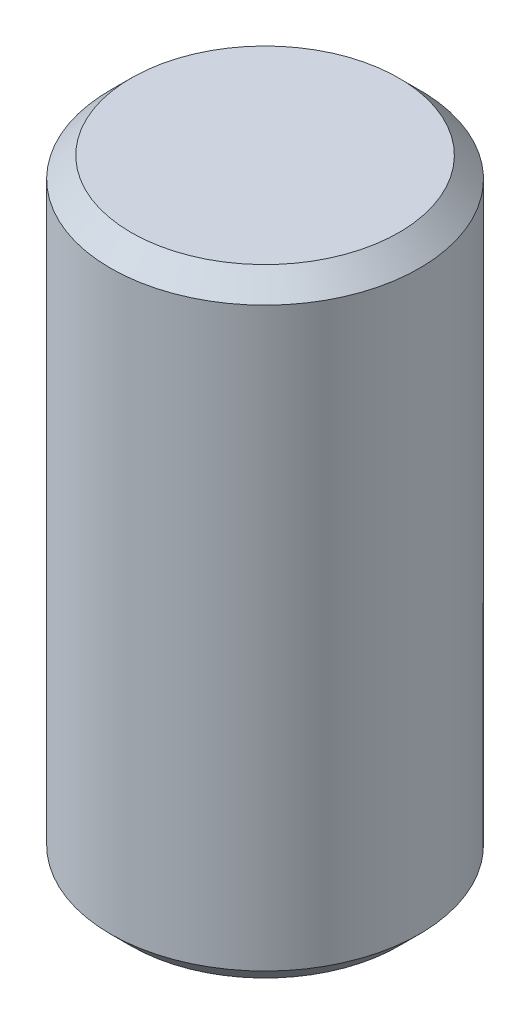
ISO-10303-21;
HEADER;
FILE_DESCRIPTION(('STEP AP214'),'2;1');
FILE_NAME('part.step','',(''),(''),'','','');
FILE_SCHEMA(('AUTOMOTIVE_DESIGN { 1 0 10303 214 1 1 1 1 }'));
ENDSEC;
DATA;
#1=APPLICATION_CONTEXT('core data for automotive mechanical design processes');
#2=APPLICATION_PROTOCOL_DEFINITION('international standard','automotive_design',2000,#1);
#3=PRODUCT_CONTEXT('',#1,'mechanical');
#4=PRODUCT('Part','Part','',(#3));
#5=PRODUCT_RELATED_PRODUCT_CATEGORY('part','',(#4));
#6=PRODUCT_DEFINITION_FORMATION('','',#4);
#7=PRODUCT_DEFINITION_CONTEXT('part definition',#1,'design');
#8=PRODUCT_DEFINITION('design','',#6,#7);
#9=PRODUCT_DEFINITION_SHAPE('','',#8);
#10=(LENGTH_UNIT() NAMED_UNIT(*) SI_UNIT(.MILLI.,.METRE.));
#11=(NAMED_UNIT(*) PLANE_ANGLE_UNIT() SI_UNIT($,.RADIAN.));
#12=(NAMED_UNIT(*) SI_UNIT($,.STERADIAN.) SOLID_ANGLE_UNIT());
#13=UNCERTAINTY_MEASURE_WITH_UNIT(LENGTH_MEASURE(1.E-05),#10,'distance_accuracy_value','');
#14=(GEOMETRIC_REPRESENTATION_CONTEXT(3) GLOBAL_UNCERTAINTY_ASSIGNED_CONTEXT((#13)) GLOBAL_UNIT_ASSIGNED_CONTEXT((#10,
#11,#12)) REPRESENTATION_CONTEXT('',''));
#15=CARTESIAN_POINT('',(0.,0.,0.));
#16=DIRECTION('',(0.,0.,1.));
#17=DIRECTION('',(1.,0.,0.));
#18=AXIS2_PLACEMENT_3D('',#15,#16,#17);
#19=CARTESIAN_POINT('',(0.,-3.00000000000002,0.));
#20=DIRECTION('',(0.,1.,0.));
#21=DIRECTION('',(0.,0.,1.));
#22=AXIS2_PLACEMENT_3D('',#19,#20,#21);
#23=CYLINDRICAL_SURFACE('',#22,0.75);
#24=CARTESIAN_POINT('',(0.,-2.90000000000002,0.));
#25=DIRECTION('',(0.,1.,0.));
#26=DIRECTION('',(0.,0.,1.));
#27=AXIS2_PLACEMENT_3D('',#24,#25,#26);
#28=CIRCLE('',#27,0.75);
#29=CARTESIAN_POINT('',(0.,-2.90000000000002,0.75));
#30=VERTEX_POINT('',#29);
#31=EDGE_CURVE('E47',#30,#30,#28,.T.);
#32=ORIENTED_EDGE('',*,*,#31,.T.);
#33=EDGE_LOOP('',(#32));
#34=FACE_BOUND('',#33,.T.);
#35=CARTESIAN_POINT('',(0.,-0.100000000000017,0.));
#36=DIRECTION('',(0.,1.,0.));
#37=DIRECTION('',(0.,0.,1.));
#38=AXIS2_PLACEMENT_3D('',#35,#36,#37);
#39=CIRCLE('',#38,0.75);
#40=CARTESIAN_POINT('',(0.,-0.100000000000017,0.750000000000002));
#41=VERTEX_POINT('',#40);
#42=EDGE_CURVE('E51',#41,#41,#39,.F.);
#43=ORIENTED_EDGE('',*,*,#42,.T.);
#44=EDGE_LOOP('',(#43));
#45=FACE_BOUND('',#44,.T.);
#46=ADVANCED_FACE('F36',(#34,#45),#23,.T.);
#47=CARTESIAN_POINT('',(0.,-3.00000000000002,0.));
#48=DIRECTION('',(0.,1.,0.));
#49=DIRECTION('',(0.,0.,1.));
#50=AXIS2_PLACEMENT_3D('',#47,#48,#49);
#51=PLANE('',#50);
#52=CARTESIAN_POINT('',(0.,-3.00000000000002,0.));
#53=DIRECTION('',(0.,1.,0.));
#54=DIRECTION('',(0.,0.,1.));
#55=AXIS2_PLACEMENT_3D('',#52,#53,#54);
#56=CIRCLE('',#55,0.649999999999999);
#57=CARTESIAN_POINT('',(0.,-3.00000000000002,0.650000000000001));
#58=VERTEX_POINT('',#57);
#59=EDGE_CURVE('E43',#58,#58,#56,.F.);
#60=ORIENTED_EDGE('',*,*,#59,.T.);
#61=EDGE_LOOP('',(#60));
#62=FACE_BOUND('',#61,.T.);
#63=ADVANCED_FACE('F67',(#62),#51,.F.);
#64=CARTESIAN_POINT('',(0.,0.,0.));
#65=DIRECTION('',(0.,1.,0.));
#66=DIRECTION('',(0.,0.,1.));
#67=AXIS2_PLACEMENT_3D('',#64,#65,#66);
#68=PLANE('',#67);
#69=CARTESIAN_POINT('',(0.,0.,0.));
#70=DIRECTION('',(0.,1.,0.));
#71=DIRECTION('',(0.,0.,1.));
#72=AXIS2_PLACEMENT_3D('',#69,#70,#71);
#73=CIRCLE('',#72,0.65);
#74=CARTESIAN_POINT('',(0.,0.,0.650000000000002));
#75=VERTEX_POINT('',#74);
#76=EDGE_CURVE('E10',#75,#75,#73,.T.);
#77=ORIENTED_EDGE('',*,*,#76,.T.);
#78=EDGE_LOOP('',(#77));
#79=FACE_BOUND('',#78,.T.);
#80=ADVANCED_FACE('F64',(#79),#68,.T.);
#81=CARTESIAN_POINT('',(0.,-2.90000000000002,0.));
#82=DIRECTION('',(0.,1.,0.));
#83=DIRECTION('',(0.,0.,1.));
#84=AXIS2_PLACEMENT_3D('',#81,#82,#83);
#85=CONICAL_SURFACE('',#84,0.75,0.785398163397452);
#86=ORIENTED_EDGE('',*,*,#59,.F.);
#87=EDGE_LOOP('',(#86));
#88=FACE_BOUND('',#87,.T.);
#89=ORIENTED_EDGE('',*,*,#31,.F.);
#90=EDGE_LOOP('',(#89));
#91=FACE_BOUND('',#90,.T.);
#92=ADVANCED_FACE('F60',(#88,#91),#85,.T.);
#93=CARTESIAN_POINT('',(0.,0.,0.));
#94=DIRECTION('',(0.,-1.,0.));
#95=DIRECTION('',(0.,0.,-1.));
#96=AXIS2_PLACEMENT_3D('',#93,#94,#95);
#97=CONICAL_SURFACE('',#96,0.65,0.785398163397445);
#98=ORIENTED_EDGE('',*,*,#42,.F.);
#99=EDGE_LOOP('',(#98));
#100=FACE_BOUND('',#99,.T.);
#101=ORIENTED_EDGE('',*,*,#76,.F.);
#102=EDGE_LOOP('',(#101));
#103=FACE_BOUND('',#102,.T.);
#104=ADVANCED_FACE('F38',(#100,#103),#97,.T.);
#105=CLOSED_SHELL('',(#46,#63,#80,#92,#104));
#106=MANIFOLD_SOLID_BREP('B2',#105);
#107=ADVANCED_BREP_SHAPE_REPRESENTATION('',(#18,#106),#14);
#108=SHAPE_DEFINITION_REPRESENTATION(#9,#107);
ENDSEC;
END-ISO-10303-21;
